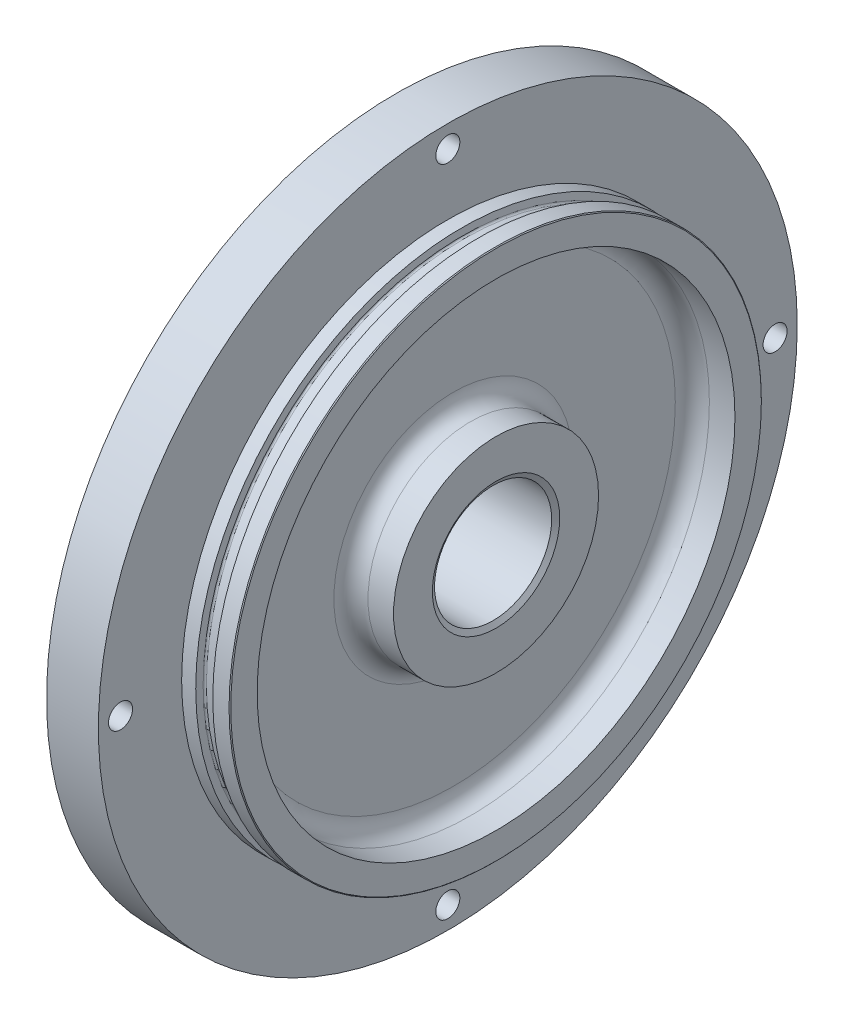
from build123d import *

# Parameters (mm, degrees)
SKETCH2_R          = 1.7907
CUT_EXTRUDE1_DEPTH = 76.132362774
CIRPATTERN1_COUNT  = 4
CIRPATTERN2_COUNT  = 4
FILLET2_R          = 2.54
CHAMFER1_SIZE      = 2.032
CHAMFER1_SIZE2     = 0.177776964
CHAMFER5_SIZE      = 0.127
SKETCH18_R         = 8.7249
CUT_EXTRUDE2_DEPTH = 19.177
SKETCH19_R         = 6.35
CUT_EXTRUDE3_DEPTH = 77.882321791
CHAMFER6_SIZE      = 0.381
CHAMFER7_SIZE      = 0.762
CHAMFER7_SIZE2     = 0.439940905
FILLET3_R          = 0.254


with BuildPart() as part:
    # Sketch1 → Revolve1 (revolve)
    with BuildSketch(Plane.XY, mode=Mode.PRIVATE) as revolve1_sk:
        Polygon((-19.812, 39.6621), (-22.352, 39.6621), (-22.352, 7.3406), (-22.352, 0), (-19.05, 0), (-0.254, 0), (-0.254, 9.525), (-0.254, 15.277083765), (-6.604, 15.277083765), (-6.604, 35.599969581), (-0.254, 35.599969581), (-0.254, 39.6621), (-2.794, 39.6621), (-5.1562, 39.6621), (-7.4422, 39.6621), (-7.4422, 52.07), (-15.1638, 52.07), (-15.1638, 43.7261), (-15.1638, 41.1353), (-15.1638, 39.6621), (-17.4498, 39.6621), align=None)
    revolve(revolve1_sk.sketch.rotate(Axis((0, 0, 0), (-1, 0, 0)), 90), axis=Axis((0, 0, 0), (-1, 0, 0)))

    # Sketch2 → Cut-Extrude1 (cut, through all)
    with BuildSketch(Plane.ZY.offset(15.1638)):
        with Locations((0, 48.768)):
            Circle(SKETCH2_R)
    cut_extrude1 = extrude(amount=-CUT_EXTRUDE1_DEPTH, mode=Mode.SUBTRACT)

    # CirPattern1: Cut-Extrude1 ×4 about axis
    cirpattern1_axis = Axis((0, 0, 0), (1, 0, 0))
    for i in range(1, CIRPATTERN1_COUNT):
        add(cut_extrude1.rotate(cirpattern1_axis, i * 360 / CIRPATTERN1_COUNT), mode=Mode.SUBTRACT)

    # Sketch5 → 10-32 Tapped Hole1 (revolve, cut)
    with BuildSketch(Plane(origin=(-22.352, 35.2044, 0), x_dir=(0, 0, 1), z_dir=(0, 1, 0))):
        Polygon((0, 0), (0, 12.897317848), (2.0193, 11.684), (2.0193, 0), align=None)
    f_10_32_tapped_hole1 = revolve(axis=Axis((-28.702, 35.2044, 0), (1, 0, 0)), mode=Mode.SUBTRACT)

    # CirPattern2: 10-32 Tapped Hole1 ×4 about axis
    cirpattern2_axis = Axis((0, 0, 0), (1, 0, 0))
    for i in range(1, CIRPATTERN2_COUNT):
        add(f_10_32_tapped_hole1.rotate(cirpattern2_axis, i * 360 / CIRPATTERN2_COUNT), mode=Mode.SUBTRACT)

    # Fillet2
    fillet2_edges = [part.edges().sort_by_distance(p)[0] for p in [
        (-6.604, 0, 15.277083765),
        (-6.604, 0, 35.599969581),
    ]]
    fillet(fillet2_edges, radius=FILLET2_R)

    # Chamfer1
    chamfer1_edges = [part.edges().sort_by_distance(p)[0] for p in [
        (-22.352, 0, 39.6621),
    ]]
    chamfer1_side = [part.faces().sort_by_distance(p)[0] for p in [
        (-18.7579, 0, 39.6621),
    ]]
    chamfer(chamfer1_edges, length=CHAMFER1_SIZE, length2=CHAMFER1_SIZE2, reference=chamfer1_side[0])

    # Sketch7 → Groove for AS 568-042_ O-Ring1 (revolve, cut)
    with BuildSketch(Plane(origin=(-15.1638, 0, 0), x_dir=(0, 0, 1), z_dir=(0, -1, 0)), mode=Mode.PRIVATE) as groove_for_as_568_042_o_ring1_sk:
        with BuildLine():
            Line((41.1353, -1.088937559), (41.040030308, 0))
            Line((41.040030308, 0), (43.872169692, 0))
            Line((43.872169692, 0), (43.7769, -1.088937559))
            ThreePointArc((43.7769, -1.088937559), (43.695466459, -1.254068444), (43.523866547, -1.3208))
            Line((43.523866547, -1.3208), (41.388333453, -1.3208))
            ThreePointArc((41.388333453, -1.3208), (41.216733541, -1.254068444), (41.1353, -1.088937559))
        make_face()
    revolve(groove_for_as_568_042_o_ring1_sk.sketch.rotate(Axis((-65.1638, 0, 0), (1, 0, 0)), 180), axis=Axis((-65.1638, 0, 0), (1, 0, 0)), mode=Mode.SUBTRACT)

    # Sketch13 → Groove for AS 568-041_ O-Ring2 (revolve, cut)
    with BuildSketch(Plane(origin=(0, 0, 0), x_dir=(0, 0, -1), z_dir=(0, -1, 0)), mode=Mode.PRIVATE) as groove_for_as_568_041_o_ring2_sk:
        with BuildLine():
            Line((38.649362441, -17.35119699), (39.7764, -17.25259398))
            Line((39.7764, -17.25259398), (39.7764, -19.812))
            Line((39.7764, -19.812), (38.649362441, -19.71339699))
            ThreePointArc((38.649362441, -19.71339699), (38.484231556, -19.63196345), (38.4175, -19.460363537))
            Line((38.4175, -19.460363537), (38.4175, -17.604230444))
            ThreePointArc((38.4175, -17.604230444), (38.484231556, -17.432630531), (38.649362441, -17.35119699))
        make_face()
    revolve(groove_for_as_568_041_o_ring2_sk.sketch.rotate(Axis((50, 0, 0), (-1, 0, 0)), 180), axis=Axis((50, 0, 0), (-1, 0, 0)), mode=Mode.SUBTRACT)

    # Chamfer5
    chamfer5_edges = [part.edges().sort_by_distance(p)[0] for p in [
        (-0.254, 0, 39.6621),
    ]]
    chamfer(chamfer5_edges, length=CHAMFER5_SIZE)

    # Sketch18 → Cut-Extrude2 (cut)
    with BuildSketch(Plane(origin=(-0.254, 0, 0), x_dir=(0, 0, -1), z_dir=(1, 0, 0))):
        Circle(SKETCH18_R)
    extrude(amount=-CUT_EXTRUDE2_DEPTH, mode=Mode.SUBTRACT)

    # Sketch19 → Cut-Extrude3 (cut, through all)
    with BuildSketch(Plane.ZY.offset(22.352)):
        Circle(SKETCH19_R)
    extrude(amount=-CUT_EXTRUDE3_DEPTH, mode=Mode.SUBTRACT)

    # Chamfer6
    chamfer6_edges = [part.edges().sort_by_distance(p)[0] for p in [
        (-19.431, 0, -6.35),
    ]]
    chamfer(chamfer6_edges, length=CHAMFER6_SIZE)

    # Chamfer7
    chamfer7_edges = [part.edges().sort_by_distance(p)[0] for p in [
        (-0.254, 0, 8.7249),
    ]]
    chamfer7_side = [part.faces().sort_by_distance(p)[0] for p in [
        (-0.254, 0, 14.844982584),
    ]]
    chamfer(chamfer7_edges, length=CHAMFER7_SIZE, length2=CHAMFER7_SIZE2, reference=chamfer7_side[0])

    # Fillet3
    fillet3_edges = [part.edges().sort_by_distance(p)[0] for p in [
        (-19.431, 0, 8.7249),
    ]]
    fillet(fillet3_edges, radius=FILLET3_R)

    # Sketch23 → Groove for AS 568-041_ O-Ring3 (revolve, cut)
    with BuildSketch(Plane(origin=(0, 0, 0), x_dir=(0, 0, -1), z_dir=(0, -1, 0)), mode=Mode.PRIVATE) as groove_for_as_568_041_o_ring3_sk:
        with BuildLine():
            Line((38.649362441, -2.89260301), (39.7764, -2.794))
            Line((39.7764, -2.794), (39.7764, -5.35340602))
            Line((39.7764, -5.35340602), (38.649362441, -5.25480301))
            ThreePointArc((38.649362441, -5.25480301), (38.484231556, -5.173369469), (38.4175, -5.001769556))
            Line((38.4175, -5.001769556), (38.4175, -3.145636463))
            ThreePointArc((38.4175, -3.145636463), (38.484231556, -2.97403655), (38.649362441, -2.89260301))
        make_face()
    revolve(groove_for_as_568_041_o_ring3_sk.sketch.rotate(Axis((50, 0, 0), (-1, 0, 0)), 180), axis=Axis((50, 0, 0), (-1, 0, 0)), mode=Mode.SUBTRACT)


solid = part.part
